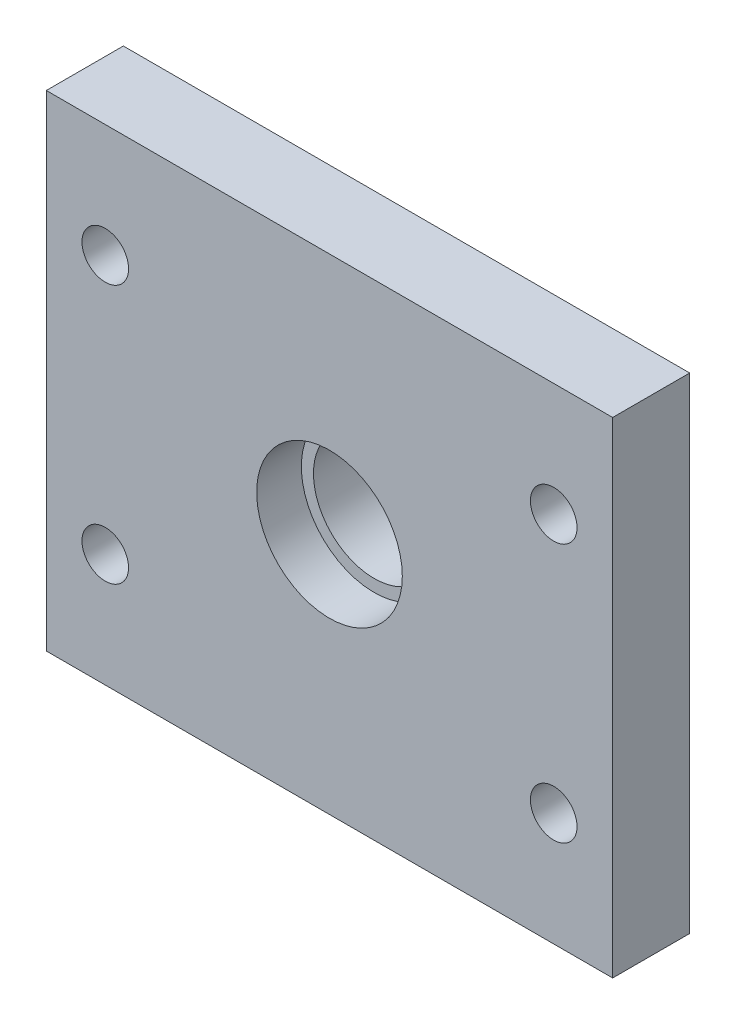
ISO-10303-21;
HEADER;
FILE_DESCRIPTION(('STEP AP214'),'2;1');
FILE_NAME('part.step','',(''),(''),'','','');
FILE_SCHEMA(('AUTOMOTIVE_DESIGN { 1 0 10303 214 1 1 1 1 }'));
ENDSEC;
DATA;
#1=APPLICATION_CONTEXT('core data for automotive mechanical design processes');
#2=APPLICATION_PROTOCOL_DEFINITION('international standard','automotive_design',2000,#1);
#3=PRODUCT_CONTEXT('',#1,'mechanical');
#4=PRODUCT('Part','Part','',(#3));
#5=PRODUCT_RELATED_PRODUCT_CATEGORY('part','',(#4));
#6=PRODUCT_DEFINITION_FORMATION('','',#4);
#7=PRODUCT_DEFINITION_CONTEXT('part definition',#1,'design');
#8=PRODUCT_DEFINITION('design','',#6,#7);
#9=PRODUCT_DEFINITION_SHAPE('','',#8);
#10=(LENGTH_UNIT() NAMED_UNIT(*) SI_UNIT(.MILLI.,.METRE.));
#11=(NAMED_UNIT(*) PLANE_ANGLE_UNIT() SI_UNIT($,.RADIAN.));
#12=(NAMED_UNIT(*) SI_UNIT($,.STERADIAN.) SOLID_ANGLE_UNIT());
#13=UNCERTAINTY_MEASURE_WITH_UNIT(LENGTH_MEASURE(1.E-05),#10,'distance_accuracy_value','');
#14=(GEOMETRIC_REPRESENTATION_CONTEXT(3) GLOBAL_UNCERTAINTY_ASSIGNED_CONTEXT((#13)) GLOBAL_UNIT_ASSIGNED_CONTEXT((#10,
#11,#12)) REPRESENTATION_CONTEXT('',''));
#15=CARTESIAN_POINT('',(0.,0.,0.));
#16=DIRECTION('',(0.,0.,1.));
#17=DIRECTION('',(1.,0.,0.));
#18=AXIS2_PLACEMENT_3D('',#15,#16,#17);
#19=CARTESIAN_POINT('',(22.225,19.05,-4.1148));
#20=DIRECTION('',(0.,0.,1.));
#21=DIRECTION('',(1.,0.,0.));
#22=AXIS2_PLACEMENT_3D('',#19,#20,#21);
#23=CYLINDRICAL_SURFACE('',#22,4.7625);
#24=CARTESIAN_POINT('',(22.225,19.05,-4.1148));
#25=DIRECTION('',(0.,0.,1.));
#26=DIRECTION('',(1.,0.,0.));
#27=AXIS2_PLACEMENT_3D('',#24,#25,#26);
#28=CIRCLE('',#27,4.7625);
#29=CARTESIAN_POINT('',(26.9875,19.05,-4.1148));
#30=VERTEX_POINT('',#29);
#31=EDGE_CURVE('E188',#30,#30,#28,.T.);
#32=ORIENTED_EDGE('',*,*,#31,.F.);
#33=EDGE_LOOP('',(#32));
#34=FACE_BOUND('',#33,.T.);
#35=CARTESIAN_POINT('',(22.225,19.05,2.54));
#36=DIRECTION('',(0.,0.,1.));
#37=DIRECTION('',(1.,0.,0.));
#38=AXIS2_PLACEMENT_3D('',#35,#36,#37);
#39=CIRCLE('',#38,4.7625);
#40=CARTESIAN_POINT('',(26.9875,19.05,2.54));
#41=VERTEX_POINT('',#40);
#42=EDGE_CURVE('E33',#41,#41,#39,.F.);
#43=ORIENTED_EDGE('',*,*,#42,.F.);
#44=EDGE_LOOP('',(#43));
#45=FACE_BOUND('',#44,.T.);
#46=ADVANCED_FACE('F29',(#34,#45),#23,.F.);
#47=CARTESIAN_POINT('',(22.225,19.05,-9.525));
#48=DIRECTION('',(0.,0.,1.));
#49=DIRECTION('',(1.,0.,0.));
#50=AXIS2_PLACEMENT_3D('',#47,#48,#49);
#51=CYLINDRICAL_SURFACE('',#50,2.3495);
#52=CARTESIAN_POINT('',(22.225,19.05,-9.525));
#53=DIRECTION('',(0.,0.,1.));
#54=DIRECTION('',(1.,0.,0.));
#55=AXIS2_PLACEMENT_3D('',#52,#53,#54);
#56=CIRCLE('',#55,2.3495);
#57=CARTESIAN_POINT('',(24.5745,19.05,-9.525));
#58=VERTEX_POINT('',#57);
#59=EDGE_CURVE('E119',#58,#58,#56,.T.);
#60=ORIENTED_EDGE('',*,*,#59,.F.);
#61=EDGE_LOOP('',(#60));
#62=FACE_BOUND('',#61,.T.);
#63=CARTESIAN_POINT('',(22.225,19.05,-4.1148));
#64=DIRECTION('',(0.,0.,1.));
#65=DIRECTION('',(1.,0.,0.));
#66=AXIS2_PLACEMENT_3D('',#63,#64,#65);
#67=CIRCLE('',#66,2.3495);
#68=CARTESIAN_POINT('',(24.5745,19.05,-4.1148));
#69=VERTEX_POINT('',#68);
#70=EDGE_CURVE('E186',#69,#69,#67,.F.);
#71=ORIENTED_EDGE('',*,*,#70,.F.);
#72=EDGE_LOOP('',(#71));
#73=FACE_BOUND('',#72,.T.);
#74=ADVANCED_FACE('F237',(#62,#73),#51,.F.);
#75=CARTESIAN_POINT('',(0.,38.1,0.));
#76=DIRECTION('',(0.,0.,-1.));
#77=DIRECTION('',(-1.,0.,0.));
#78=AXIS2_PLACEMENT_3D('',#75,#76,#77);
#79=PLANE('',#78);
#80=DIRECTION('',(0.,-1.,0.));
#81=VECTOR('',#80,1.);
#82=CARTESIAN_POINT('',(0.,0.,0.));
#83=LINE('',#82,#81);
#84=CARTESIAN_POINT('',(0.,38.1,0.));
#85=VERTEX_POINT('',#84);
#86=CARTESIAN_POINT('',(0.,0.,0.));
#87=VERTEX_POINT('',#86);
#88=EDGE_CURVE('E163',#85,#87,#83,.T.);
#89=ORIENTED_EDGE('',*,*,#88,.F.);
#90=DIRECTION('',(-1.,0.,0.));
#91=VECTOR('',#90,1.);
#92=CARTESIAN_POINT('',(0.,38.1,0.));
#93=LINE('',#92,#91);
#94=CARTESIAN_POINT('',(44.45,38.1,0.));
#95=VERTEX_POINT('',#94);
#96=EDGE_CURVE('E170',#95,#85,#93,.T.);
#97=ORIENTED_EDGE('',*,*,#96,.F.);
#98=DIRECTION('',(0.,1.,0.));
#99=VECTOR('',#98,1.);
#100=CARTESIAN_POINT('',(44.45,0.,0.));
#101=LINE('',#100,#99);
#102=CARTESIAN_POINT('',(44.45,0.,0.));
#103=VERTEX_POINT('',#102);
#104=EDGE_CURVE('E168',#103,#95,#101,.T.);
#105=ORIENTED_EDGE('',*,*,#104,.F.);
#106=DIRECTION('',(1.,0.,0.));
#107=VECTOR('',#106,1.);
#108=CARTESIAN_POINT('',(0.,0.,0.));
#109=LINE('',#108,#107);
#110=EDGE_CURVE('E166',#87,#103,#109,.T.);
#111=ORIENTED_EDGE('',*,*,#110,.F.);
#112=EDGE_LOOP('',(#89,#97,#105,#111));
#113=FACE_BOUND('',#112,.T.);
#114=CARTESIAN_POINT('',(4.62736379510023,8.88999999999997,0.));
#115=DIRECTION('',(0.,0.,1.));
#116=DIRECTION('',(1.,0.,0.));
#117=AXIS2_PLACEMENT_3D('',#114,#115,#116);
#118=CIRCLE('',#117,1.8288);
#119=CARTESIAN_POINT('',(6.45616379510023,8.88999999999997,0.));
#120=VERTEX_POINT('',#119);
#121=EDGE_CURVE('E160',#120,#120,#118,.T.);
#122=ORIENTED_EDGE('',*,*,#121,.T.);
#123=EDGE_LOOP('',(#122));
#124=FACE_BOUND('',#123,.T.);
#125=CARTESIAN_POINT('',(4.62736379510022,29.21,0.));
#126=DIRECTION('',(0.,0.,1.));
#127=DIRECTION('',(1.,0.,0.));
#128=AXIS2_PLACEMENT_3D('',#125,#126,#127);
#129=CIRCLE('',#128,1.8288);
#130=CARTESIAN_POINT('',(6.45616379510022,29.21,0.));
#131=VERTEX_POINT('',#130);
#132=EDGE_CURVE('E154',#131,#131,#129,.T.);
#133=ORIENTED_EDGE('',*,*,#132,.T.);
#134=EDGE_LOOP('',(#133));
#135=FACE_BOUND('',#134,.T.);
#136=CARTESIAN_POINT('',(39.8226362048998,29.21,0.));
#137=DIRECTION('',(0.,0.,1.));
#138=DIRECTION('',(1.,0.,0.));
#139=AXIS2_PLACEMENT_3D('',#136,#137,#138);
#140=CIRCLE('',#139,1.8288);
#141=CARTESIAN_POINT('',(41.6514362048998,29.21,0.));
#142=VERTEX_POINT('',#141);
#143=EDGE_CURVE('E148',#142,#142,#140,.T.);
#144=ORIENTED_EDGE('',*,*,#143,.T.);
#145=EDGE_LOOP('',(#144));
#146=FACE_BOUND('',#145,.T.);
#147=CARTESIAN_POINT('',(39.8226362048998,8.88999999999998,0.));
#148=DIRECTION('',(0.,0.,1.));
#149=DIRECTION('',(1.,0.,0.));
#150=AXIS2_PLACEMENT_3D('',#147,#148,#149);
#151=CIRCLE('',#150,1.8288);
#152=CARTESIAN_POINT('',(41.6514362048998,8.88999999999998,0.));
#153=VERTEX_POINT('',#152);
#154=EDGE_CURVE('E142',#153,#153,#151,.T.);
#155=ORIENTED_EDGE('',*,*,#154,.T.);
#156=EDGE_LOOP('',(#155));
#157=FACE_BOUND('',#156,.T.);
#158=DIRECTION('',(-1.,0.,0.));
#159=VECTOR('',#158,1.);
#160=CARTESIAN_POINT('',(28.575,12.7,0.));
#161=LINE('',#160,#159);
#162=CARTESIAN_POINT('',(28.575,12.7,0.));
#163=VERTEX_POINT('',#162);
#164=CARTESIAN_POINT('',(15.875,12.7,0.));
#165=VERTEX_POINT('',#164);
#166=EDGE_CURVE('E102',#163,#165,#161,.T.);
#167=ORIENTED_EDGE('',*,*,#166,.F.);
#168=DIRECTION('',(0.,-1.,0.));
#169=VECTOR('',#168,1.);
#170=CARTESIAN_POINT('',(28.575,25.4,0.));
#171=LINE('',#170,#169);
#172=CARTESIAN_POINT('',(28.575,25.4,0.));
#173=VERTEX_POINT('',#172);
#174=EDGE_CURVE('E113',#173,#163,#171,.T.);
#175=ORIENTED_EDGE('',*,*,#174,.F.);
#176=DIRECTION('',(1.,0.,0.));
#177=VECTOR('',#176,1.);
#178=CARTESIAN_POINT('',(28.575,25.4,0.));
#179=LINE('',#178,#177);
#180=CARTESIAN_POINT('',(15.875,25.4,0.));
#181=VERTEX_POINT('',#180);
#182=EDGE_CURVE('E125',#181,#173,#179,.T.);
#183=ORIENTED_EDGE('',*,*,#182,.F.);
#184=DIRECTION('',(0.,1.,0.));
#185=VECTOR('',#184,1.);
#186=CARTESIAN_POINT('',(15.875,25.4,0.));
#187=LINE('',#186,#185);
#188=EDGE_CURVE('E123',#165,#181,#187,.T.);
#189=ORIENTED_EDGE('',*,*,#188,.F.);
#190=EDGE_LOOP('',(#167,#175,#183,#189));
#191=FACE_BOUND('',#190,.T.);
#192=ADVANCED_FACE('F122',(#113,#124,#135,#146,#157,#191),#79,.T.);
#193=CARTESIAN_POINT('',(0.,0.,6.0452));
#194=DIRECTION('',(1.,0.,0.));
#195=DIRECTION('',(0.,1.,0.));
#196=AXIS2_PLACEMENT_3D('',#193,#194,#195);
#197=PLANE('',#196);
#198=ORIENTED_EDGE('',*,*,#88,.T.);
#199=DIRECTION('',(0.,0.,-1.));
#200=VECTOR('',#199,1.);
#201=CARTESIAN_POINT('',(0.,0.,6.0452));
#202=LINE('',#201,#200);
#203=CARTESIAN_POINT('',(0.,0.,6.0452));
#204=VERTEX_POINT('',#203);
#205=EDGE_CURVE('E11',#204,#87,#202,.T.);
#206=ORIENTED_EDGE('',*,*,#205,.F.);
#207=DIRECTION('',(0.,-1.,0.));
#208=VECTOR('',#207,1.);
#209=CARTESIAN_POINT('',(0.,0.,6.0452));
#210=LINE('',#209,#208);
#211=CARTESIAN_POINT('',(0.,38.1,6.0452));
#212=VERTEX_POINT('',#211);
#213=EDGE_CURVE('E172',#212,#204,#210,.T.);
#214=ORIENTED_EDGE('',*,*,#213,.F.);
#215=DIRECTION('',(0.,0.,-1.));
#216=VECTOR('',#215,1.);
#217=CARTESIAN_POINT('',(0.,38.1,6.0452));
#218=LINE('',#217,#216);
#219=EDGE_CURVE('E179',#212,#85,#218,.T.);
#220=ORIENTED_EDGE('',*,*,#219,.T.);
#221=EDGE_LOOP('',(#198,#206,#214,#220));
#222=FACE_BOUND('',#221,.T.);
#223=ADVANCED_FACE('F31',(#222),#197,.F.);
#224=CARTESIAN_POINT('',(0.,0.,6.0452));
#225=DIRECTION('',(0.,1.,0.));
#226=DIRECTION('',(0.,0.,1.));
#227=AXIS2_PLACEMENT_3D('',#224,#225,#226);
#228=PLANE('',#227);
#229=ORIENTED_EDGE('',*,*,#110,.T.);
#230=DIRECTION('',(0.,0.,-1.));
#231=VECTOR('',#230,1.);
#232=CARTESIAN_POINT('',(44.45,0.,6.0452));
#233=LINE('',#232,#231);
#234=CARTESIAN_POINT('',(44.45,0.,6.0452));
#235=VERTEX_POINT('',#234);
#236=EDGE_CURVE('E38',#235,#103,#233,.T.);
#237=ORIENTED_EDGE('',*,*,#236,.F.);
#238=DIRECTION('',(1.,0.,0.));
#239=VECTOR('',#238,1.);
#240=CARTESIAN_POINT('',(0.,0.,6.0452));
#241=LINE('',#240,#239);
#242=EDGE_CURVE('E174',#204,#235,#241,.T.);
#243=ORIENTED_EDGE('',*,*,#242,.F.);
#244=ORIENTED_EDGE('',*,*,#205,.T.);
#245=EDGE_LOOP('',(#229,#237,#243,#244));
#246=FACE_BOUND('',#245,.T.);
#247=ADVANCED_FACE('F226',(#246),#228,.F.);
#248=CARTESIAN_POINT('',(44.45,0.,6.0452));
#249=DIRECTION('',(-1.,0.,0.));
#250=DIRECTION('',(0.,-1.,0.));
#251=AXIS2_PLACEMENT_3D('',#248,#249,#250);
#252=PLANE('',#251);
#253=ORIENTED_EDGE('',*,*,#104,.T.);
#254=DIRECTION('',(0.,0.,-1.));
#255=VECTOR('',#254,1.);
#256=CARTESIAN_POINT('',(44.45,38.1,6.0452));
#257=LINE('',#256,#255);
#258=CARTESIAN_POINT('',(44.45,38.1,6.0452));
#259=VERTEX_POINT('',#258);
#260=EDGE_CURVE('E182',#259,#95,#257,.T.);
#261=ORIENTED_EDGE('',*,*,#260,.F.);
#262=DIRECTION('',(0.,1.,0.));
#263=VECTOR('',#262,1.);
#264=CARTESIAN_POINT('',(44.45,0.,6.0452));
#265=LINE('',#264,#263);
#266=EDGE_CURVE('E176',#235,#259,#265,.T.);
#267=ORIENTED_EDGE('',*,*,#266,.F.);
#268=ORIENTED_EDGE('',*,*,#236,.T.);
#269=EDGE_LOOP('',(#253,#261,#267,#268));
#270=FACE_BOUND('',#269,.T.);
#271=ADVANCED_FACE('F231',(#270),#252,.F.);
#272=CARTESIAN_POINT('',(0.,38.1,6.0452));
#273=DIRECTION('',(0.,-1.,0.));
#274=DIRECTION('',(0.,0.,-1.));
#275=AXIS2_PLACEMENT_3D('',#272,#273,#274);
#276=PLANE('',#275);
#277=ORIENTED_EDGE('',*,*,#96,.T.);
#278=ORIENTED_EDGE('',*,*,#219,.F.);
#279=DIRECTION('',(-1.,0.,0.));
#280=VECTOR('',#279,1.);
#281=CARTESIAN_POINT('',(0.,38.1,6.0452));
#282=LINE('',#281,#280);
#283=EDGE_CURVE('E54',#259,#212,#282,.T.);
#284=ORIENTED_EDGE('',*,*,#283,.F.);
#285=ORIENTED_EDGE('',*,*,#260,.T.);
#286=EDGE_LOOP('',(#277,#278,#284,#285));
#287=FACE_BOUND('',#286,.T.);
#288=ADVANCED_FACE('F211',(#287),#276,.F.);
#289=CARTESIAN_POINT('',(0.,38.1,6.0452));
#290=DIRECTION('',(0.,0.,-1.));
#291=DIRECTION('',(-1.,0.,0.));
#292=AXIS2_PLACEMENT_3D('',#289,#290,#291);
#293=PLANE('',#292);
#294=CARTESIAN_POINT('',(22.225,19.05,6.0452));
#295=DIRECTION('',(0.,0.,1.));
#296=DIRECTION('',(1.,0.,0.));
#297=AXIS2_PLACEMENT_3D('',#294,#295,#296);
#298=CIRCLE('',#297,5.715);
#299=CARTESIAN_POINT('',(27.94,19.05,6.0452));
#300=VERTEX_POINT('',#299);
#301=EDGE_CURVE('E201',#300,#300,#298,.T.);
#302=ORIENTED_EDGE('',*,*,#301,.F.);
#303=EDGE_LOOP('',(#302));
#304=FACE_BOUND('',#303,.T.);
#305=CARTESIAN_POINT('',(39.8226362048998,8.88999999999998,6.0452));
#306=DIRECTION('',(0.,0.,1.));
#307=DIRECTION('',(1.,0.,0.));
#308=AXIS2_PLACEMENT_3D('',#305,#306,#307);
#309=CIRCLE('',#308,1.8288);
#310=CARTESIAN_POINT('',(41.6514362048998,8.88999999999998,6.0452));
#311=VERTEX_POINT('',#310);
#312=EDGE_CURVE('E108',#311,#311,#309,.T.);
#313=ORIENTED_EDGE('',*,*,#312,.F.);
#314=EDGE_LOOP('',(#313));
#315=FACE_BOUND('',#314,.T.);
#316=CARTESIAN_POINT('',(39.8226362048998,29.21,6.0452));
#317=DIRECTION('',(0.,0.,1.));
#318=DIRECTION('',(1.,0.,0.));
#319=AXIS2_PLACEMENT_3D('',#316,#317,#318);
#320=CIRCLE('',#319,1.8288);
#321=CARTESIAN_POINT('',(41.6514362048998,29.21,6.0452));
#322=VERTEX_POINT('',#321);
#323=EDGE_CURVE('E145',#322,#322,#320,.T.);
#324=ORIENTED_EDGE('',*,*,#323,.F.);
#325=EDGE_LOOP('',(#324));
#326=FACE_BOUND('',#325,.T.);
#327=CARTESIAN_POINT('',(4.62736379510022,29.21,6.0452));
#328=DIRECTION('',(0.,0.,1.));
#329=DIRECTION('',(1.,0.,0.));
#330=AXIS2_PLACEMENT_3D('',#327,#328,#329);
#331=CIRCLE('',#330,1.8288);
#332=CARTESIAN_POINT('',(6.45616379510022,29.21,6.0452));
#333=VERTEX_POINT('',#332);
#334=EDGE_CURVE('E151',#333,#333,#331,.T.);
#335=ORIENTED_EDGE('',*,*,#334,.F.);
#336=EDGE_LOOP('',(#335));
#337=FACE_BOUND('',#336,.T.);
#338=CARTESIAN_POINT('',(4.62736379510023,8.88999999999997,6.0452));
#339=DIRECTION('',(0.,0.,1.));
#340=DIRECTION('',(1.,0.,0.));
#341=AXIS2_PLACEMENT_3D('',#338,#339,#340);
#342=CIRCLE('',#341,1.8288);
#343=CARTESIAN_POINT('',(6.45616379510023,8.88999999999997,6.0452));
#344=VERTEX_POINT('',#343);
#345=EDGE_CURVE('E157',#344,#344,#342,.T.);
#346=ORIENTED_EDGE('',*,*,#345,.F.);
#347=EDGE_LOOP('',(#346));
#348=FACE_BOUND('',#347,.T.);
#349=ORIENTED_EDGE('',*,*,#213,.T.);
#350=ORIENTED_EDGE('',*,*,#242,.T.);
#351=ORIENTED_EDGE('',*,*,#266,.T.);
#352=ORIENTED_EDGE('',*,*,#283,.T.);
#353=EDGE_LOOP('',(#349,#350,#351,#352));
#354=FACE_BOUND('',#353,.T.);
#355=ADVANCED_FACE('F207',(#304,#315,#326,#337,#348,#354),#293,.F.);
#356=CARTESIAN_POINT('',(4.62736379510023,8.88999999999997,0.));
#357=DIRECTION('',(0.,0.,1.));
#358=DIRECTION('',(1.,0.,0.));
#359=AXIS2_PLACEMENT_3D('',#356,#357,#358);
#360=CYLINDRICAL_SURFACE('',#359,1.8288);
#361=ORIENTED_EDGE('',*,*,#121,.F.);
#362=EDGE_LOOP('',(#361));
#363=FACE_BOUND('',#362,.T.);
#364=ORIENTED_EDGE('',*,*,#345,.T.);
#365=EDGE_LOOP('',(#364));
#366=FACE_BOUND('',#365,.T.);
#367=ADVANCED_FACE('F210',(#363,#366),#360,.F.);
#368=CARTESIAN_POINT('',(4.62736379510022,29.21,0.));
#369=DIRECTION('',(0.,0.,1.));
#370=DIRECTION('',(1.,0.,0.));
#371=AXIS2_PLACEMENT_3D('',#368,#369,#370);
#372=CYLINDRICAL_SURFACE('',#371,1.8288);
#373=ORIENTED_EDGE('',*,*,#132,.F.);
#374=EDGE_LOOP('',(#373));
#375=FACE_BOUND('',#374,.T.);
#376=ORIENTED_EDGE('',*,*,#334,.T.);
#377=EDGE_LOOP('',(#376));
#378=FACE_BOUND('',#377,.T.);
#379=ADVANCED_FACE('F257',(#375,#378),#372,.F.);
#380=CARTESIAN_POINT('',(39.8226362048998,29.21,0.));
#381=DIRECTION('',(0.,0.,1.));
#382=DIRECTION('',(1.,0.,0.));
#383=AXIS2_PLACEMENT_3D('',#380,#381,#382);
#384=CYLINDRICAL_SURFACE('',#383,1.8288);
#385=ORIENTED_EDGE('',*,*,#143,.F.);
#386=EDGE_LOOP('',(#385));
#387=FACE_BOUND('',#386,.T.);
#388=ORIENTED_EDGE('',*,*,#323,.T.);
#389=EDGE_LOOP('',(#388));
#390=FACE_BOUND('',#389,.T.);
#391=ADVANCED_FACE('F250',(#387,#390),#384,.F.);
#392=CARTESIAN_POINT('',(39.8226362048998,8.88999999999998,0.));
#393=DIRECTION('',(0.,0.,1.));
#394=DIRECTION('',(1.,0.,0.));
#395=AXIS2_PLACEMENT_3D('',#392,#393,#394);
#396=CYLINDRICAL_SURFACE('',#395,1.8288);
#397=ORIENTED_EDGE('',*,*,#154,.F.);
#398=EDGE_LOOP('',(#397));
#399=FACE_BOUND('',#398,.T.);
#400=ORIENTED_EDGE('',*,*,#312,.T.);
#401=EDGE_LOOP('',(#400));
#402=FACE_BOUND('',#401,.T.);
#403=ADVANCED_FACE('F247',(#399,#402),#396,.F.);
#404=CARTESIAN_POINT('',(28.575,25.4,-9.525));
#405=DIRECTION('',(-1.,0.,0.));
#406=DIRECTION('',(0.,0.,1.));
#407=AXIS2_PLACEMENT_3D('',#404,#405,#406);
#408=PLANE('',#407);
#409=ORIENTED_EDGE('',*,*,#174,.T.);
#410=DIRECTION('',(0.,0.,1.));
#411=VECTOR('',#410,1.);
#412=CARTESIAN_POINT('',(28.575,12.7,-9.525));
#413=LINE('',#412,#411);
#414=CARTESIAN_POINT('',(28.575,12.7,-9.525));
#415=VERTEX_POINT('',#414);
#416=EDGE_CURVE('E97',#415,#163,#413,.T.);
#417=ORIENTED_EDGE('',*,*,#416,.F.);
#418=DIRECTION('',(0.,-1.,0.));
#419=VECTOR('',#418,1.);
#420=CARTESIAN_POINT('',(28.575,25.4,-9.525));
#421=LINE('',#420,#419);
#422=CARTESIAN_POINT('',(28.575,25.4,-9.525));
#423=VERTEX_POINT('',#422);
#424=EDGE_CURVE('E130',#423,#415,#421,.T.);
#425=ORIENTED_EDGE('',*,*,#424,.F.);
#426=DIRECTION('',(0.,0.,1.));
#427=VECTOR('',#426,1.);
#428=CARTESIAN_POINT('',(28.575,25.4,-9.525));
#429=LINE('',#428,#427);
#430=EDGE_CURVE('E116',#423,#173,#429,.T.);
#431=ORIENTED_EDGE('',*,*,#430,.T.);
#432=EDGE_LOOP('',(#409,#417,#425,#431));
#433=FACE_BOUND('',#432,.T.);
#434=ADVANCED_FACE('F114',(#433),#408,.F.);
#435=CARTESIAN_POINT('',(28.575,12.7,-9.525));
#436=DIRECTION('',(0.,1.,0.));
#437=DIRECTION('',(0.,0.,1.));
#438=AXIS2_PLACEMENT_3D('',#435,#436,#437);
#439=PLANE('',#438);
#440=ORIENTED_EDGE('',*,*,#166,.T.);
#441=DIRECTION('',(0.,0.,1.));
#442=VECTOR('',#441,1.);
#443=CARTESIAN_POINT('',(15.875,12.7,-9.525));
#444=LINE('',#443,#442);
#445=CARTESIAN_POINT('',(15.875,12.7,-9.525));
#446=VERTEX_POINT('',#445);
#447=EDGE_CURVE('E109',#446,#165,#444,.T.);
#448=ORIENTED_EDGE('',*,*,#447,.F.);
#449=DIRECTION('',(-1.,0.,0.));
#450=VECTOR('',#449,1.);
#451=CARTESIAN_POINT('',(28.575,12.7,-9.525));
#452=LINE('',#451,#450);
#453=EDGE_CURVE('E104',#415,#446,#452,.T.);
#454=ORIENTED_EDGE('',*,*,#453,.F.);
#455=ORIENTED_EDGE('',*,*,#416,.T.);
#456=EDGE_LOOP('',(#440,#448,#454,#455));
#457=FACE_BOUND('',#456,.T.);
#458=ADVANCED_FACE('F99',(#457),#439,.F.);
#459=CARTESIAN_POINT('',(15.875,25.4,-9.525));
#460=DIRECTION('',(1.,0.,0.));
#461=DIRECTION('',(0.,0.,-1.));
#462=AXIS2_PLACEMENT_3D('',#459,#460,#461);
#463=PLANE('',#462);
#464=ORIENTED_EDGE('',*,*,#188,.T.);
#465=DIRECTION('',(0.,0.,1.));
#466=VECTOR('',#465,1.);
#467=CARTESIAN_POINT('',(15.875,25.4,-9.525));
#468=LINE('',#467,#466);
#469=CARTESIAN_POINT('',(15.875,25.4,-9.525));
#470=VERTEX_POINT('',#469);
#471=EDGE_CURVE('E46',#470,#181,#468,.T.);
#472=ORIENTED_EDGE('',*,*,#471,.F.);
#473=DIRECTION('',(0.,1.,0.));
#474=VECTOR('',#473,1.);
#475=CARTESIAN_POINT('',(15.875,25.4,-9.525));
#476=LINE('',#475,#474);
#477=EDGE_CURVE('E133',#446,#470,#476,.T.);
#478=ORIENTED_EDGE('',*,*,#477,.F.);
#479=ORIENTED_EDGE('',*,*,#447,.T.);
#480=EDGE_LOOP('',(#464,#472,#478,#479));
#481=FACE_BOUND('',#480,.T.);
#482=ADVANCED_FACE('F281',(#481),#463,.F.);
#483=CARTESIAN_POINT('',(28.575,25.4,-9.525));
#484=DIRECTION('',(0.,-1.,0.));
#485=DIRECTION('',(0.,0.,-1.));
#486=AXIS2_PLACEMENT_3D('',#483,#484,#485);
#487=PLANE('',#486);
#488=ORIENTED_EDGE('',*,*,#182,.T.);
#489=ORIENTED_EDGE('',*,*,#430,.F.);
#490=DIRECTION('',(1.,0.,0.));
#491=VECTOR('',#490,1.);
#492=CARTESIAN_POINT('',(28.575,25.4,-9.525));
#493=LINE('',#492,#491);
#494=EDGE_CURVE('E135',#470,#423,#493,.T.);
#495=ORIENTED_EDGE('',*,*,#494,.F.);
#496=ORIENTED_EDGE('',*,*,#471,.T.);
#497=EDGE_LOOP('',(#488,#489,#495,#496));
#498=FACE_BOUND('',#497,.T.);
#499=ADVANCED_FACE('F277',(#498),#487,.F.);
#500=CARTESIAN_POINT('',(28.575,12.7,-9.525));
#501=DIRECTION('',(0.,0.,-1.));
#502=DIRECTION('',(-1.,0.,0.));
#503=AXIS2_PLACEMENT_3D('',#500,#501,#502);
#504=PLANE('',#503);
#505=ORIENTED_EDGE('',*,*,#59,.T.);
#506=EDGE_LOOP('',(#505));
#507=FACE_BOUND('',#506,.T.);
#508=ORIENTED_EDGE('',*,*,#424,.T.);
#509=ORIENTED_EDGE('',*,*,#453,.T.);
#510=ORIENTED_EDGE('',*,*,#477,.T.);
#511=ORIENTED_EDGE('',*,*,#494,.T.);
#512=EDGE_LOOP('',(#508,#509,#510,#511));
#513=FACE_BOUND('',#512,.T.);
#514=ADVANCED_FACE('F274',(#507,#513),#504,.T.);
#515=CARTESIAN_POINT('',(22.225,19.05,-4.1148));
#516=DIRECTION('',(0.,0.,1.));
#517=DIRECTION('',(1.,0.,0.));
#518=AXIS2_PLACEMENT_3D('',#515,#516,#517);
#519=PLANE('',#518);
#520=ORIENTED_EDGE('',*,*,#31,.T.);
#521=EDGE_LOOP('',(#520));
#522=FACE_BOUND('',#521,.T.);
#523=ORIENTED_EDGE('',*,*,#70,.T.);
#524=EDGE_LOOP('',(#523));
#525=FACE_BOUND('',#524,.T.);
#526=ADVANCED_FACE('F271',(#522,#525),#519,.T.);
#527=CARTESIAN_POINT('',(22.225,19.05,2.54));
#528=DIRECTION('',(0.,0.,1.));
#529=DIRECTION('',(1.,0.,0.));
#530=AXIS2_PLACEMENT_3D('',#527,#528,#529);
#531=PLANE('',#530);
#532=CARTESIAN_POINT('',(22.225,19.05,2.54));
#533=DIRECTION('',(0.,0.,1.));
#534=DIRECTION('',(1.,0.,0.));
#535=AXIS2_PLACEMENT_3D('',#532,#533,#534);
#536=CIRCLE('',#535,5.715);
#537=CARTESIAN_POINT('',(27.94,19.05,2.54));
#538=VERTEX_POINT('',#537);
#539=EDGE_CURVE('E197',#538,#538,#536,.T.);
#540=ORIENTED_EDGE('',*,*,#539,.T.);
#541=EDGE_LOOP('',(#540));
#542=FACE_BOUND('',#541,.T.);
#543=ORIENTED_EDGE('',*,*,#42,.T.);
#544=EDGE_LOOP('',(#543));
#545=FACE_BOUND('',#544,.T.);
#546=ADVANCED_FACE('F310',(#542,#545),#531,.T.);
#547=CARTESIAN_POINT('',(22.225,19.05,2.54));
#548=DIRECTION('',(0.,0.,1.));
#549=DIRECTION('',(1.,0.,0.));
#550=AXIS2_PLACEMENT_3D('',#547,#548,#549);
#551=CYLINDRICAL_SURFACE('',#550,5.715);
#552=ORIENTED_EDGE('',*,*,#539,.F.);
#553=EDGE_LOOP('',(#552));
#554=FACE_BOUND('',#553,.T.);
#555=ORIENTED_EDGE('',*,*,#301,.T.);
#556=EDGE_LOOP('',(#555));
#557=FACE_BOUND('',#556,.T.);
#558=ADVANCED_FACE('F205',(#554,#557),#551,.F.);
#559=CLOSED_SHELL('',(#46,#74,#192,#223,#247,#271,#288,#355,#367,#379,#391,#403,#434,#458,#482,
#499,#514,#526,#546,#558));
#560=MANIFOLD_SOLID_BREP('B2',#559);
#561=ADVANCED_BREP_SHAPE_REPRESENTATION('',(#18,#560),#14);
#562=SHAPE_DEFINITION_REPRESENTATION(#9,#561);
ENDSEC;
END-ISO-10303-21;
